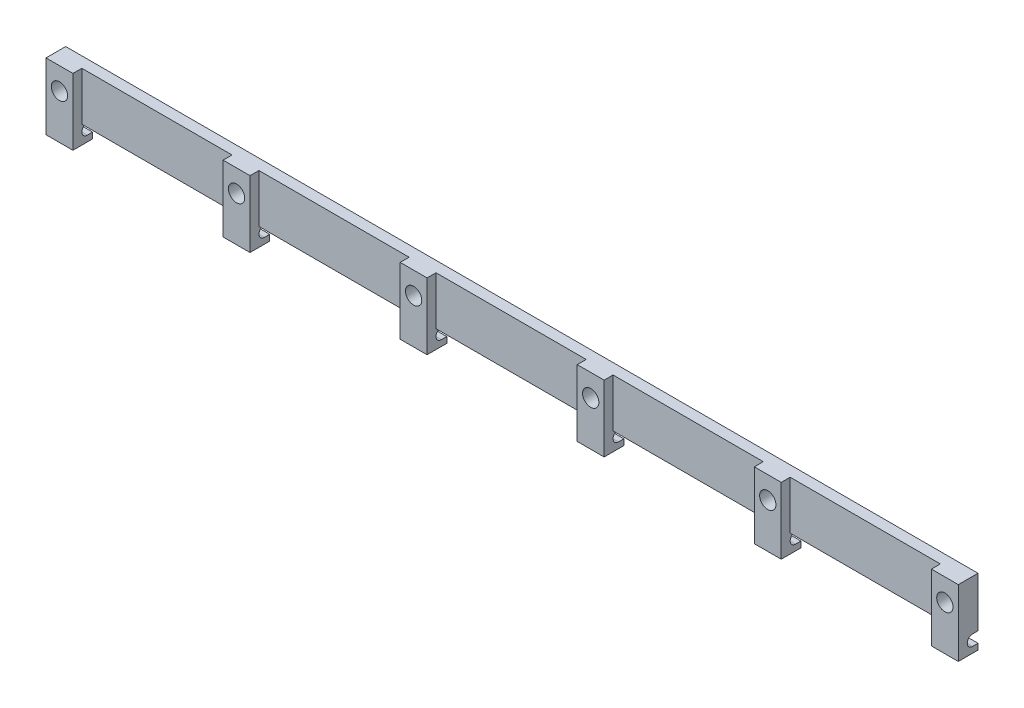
from build123d import *

# Parameters (mm, degrees)
SKETCH2_W           = 163.576
SKETCH2_H           = 8.6868
BOSS_EXTRUDE1_DEPTH = 1.9304
SKETCH3_W           = 4.826
SKETCH3_H           = 11.938
BOSS_EXTRUDE2_DEPTH = 3.5306
SKETCH4_R           = 1.4605
CUT_EXTRUDE1_DEPTH  = 83.730030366
LPATTERN1_COUNT     = 6
LPATTERN1_PITCH     = 31.75
SKETCH5_R           = 2.1209
BOSS_EXTRUDE3_DEPTH = 1.27
CUT_EXTRUDE2_DEPTH  = 165.049043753


with BuildPart() as part:
    # Sketch2 → Boss-Extrude1 (new body)
    with BuildSketch(Plane.XY):
        with Locations((0, -4.3434)):
            Rectangle(SKETCH2_W, SKETCH2_H)
    extrude(amount=BOSS_EXTRUDE1_DEPTH)

    # Sketch3 → Boss-Extrude2 (add)
    with BuildSketch(Plane(origin=(0, 0, 0), x_dir=(-1, 0, 0), z_dir=(0, 0, -1))):
        with Locations((79.375, -5.969)):
            Rectangle(SKETCH3_W, SKETCH3_H)
        with Locations((47.625, -5.969)):
            Rectangle(SKETCH3_W, SKETCH3_H)
        with Locations((15.875, -5.969)):
            Rectangle(SKETCH3_W, SKETCH3_H)
        with Locations((-15.875, -5.969)):
            Rectangle(SKETCH3_W, SKETCH3_H)
        with Locations((-47.625, -5.969)):
            Rectangle(SKETCH3_W, SKETCH3_H)
        with Locations((-79.375, -5.969)):
            Rectangle(SKETCH3_W, SKETCH3_H)
    extrude(amount=-BOSS_EXTRUDE2_DEPTH)

    # Sketch4 → Cut-Extrude1 (cut, through all)
    with BuildSketch(Plane.XY.offset(3.5306)):
        with Locations((-79.375, -3.9624)):
            Circle(SKETCH4_R)
    cut_extrude1 = extrude(amount=-CUT_EXTRUDE1_DEPTH, mode=Mode.SUBTRACT)

    # LPattern1: Cut-Extrude1 ×6
    with Locations(*[(i * LPATTERN1_PITCH, 0, 0) for i in range(1, LPATTERN1_COUNT)]):
        add(cut_extrude1, mode=Mode.SUBTRACT)

    # Sketch5 → Boss-Extrude3 (add)
    with BuildSketch(Plane(origin=(0, 0, 0), x_dir=(-1, 0, 0), z_dir=(0, 0, -1))):
        with Locations(Location((63.5635, -3.9624, 0), (0, 0, 180))):
            Circle(SKETCH5_R)
    extrude(amount=BOSS_EXTRUDE3_DEPTH)

    # Sketch6 → Cut-Extrude2 (cut, through all)
    with BuildSketch(Plane.ZY.offset(81.788)):
        with BuildLine():
            Line((0.9652, -10.8712), (0, -10.8712))
            Line((0, -10.8712), (0, -8.9408))
            Line((0, -8.9408), (0.9652, -8.9408))
            ThreePointArc((0.9652, -8.9408), (1.9304, -9.906), (0.9652, -10.8712))
        make_face()
    extrude(amount=-CUT_EXTRUDE2_DEPTH, mode=Mode.SUBTRACT)


solid = part.part
